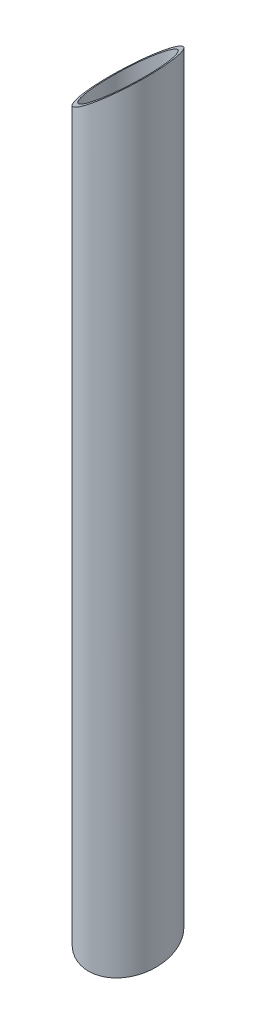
ISO-10303-21;
HEADER;
FILE_DESCRIPTION(('STEP AP214'),'2;1');
FILE_NAME('part.step','',(''),(''),'','','');
FILE_SCHEMA(('AUTOMOTIVE_DESIGN { 1 0 10303 214 1 1 1 1 }'));
ENDSEC;
DATA;
#1=APPLICATION_CONTEXT('core data for automotive mechanical design processes');
#2=APPLICATION_PROTOCOL_DEFINITION('international standard','automotive_design',2000,#1);
#3=PRODUCT_CONTEXT('',#1,'mechanical');
#4=PRODUCT('Part','Part','',(#3));
#5=PRODUCT_RELATED_PRODUCT_CATEGORY('part','',(#4));
#6=PRODUCT_DEFINITION_FORMATION('','',#4);
#7=PRODUCT_DEFINITION_CONTEXT('part definition',#1,'design');
#8=PRODUCT_DEFINITION('design','',#6,#7);
#9=PRODUCT_DEFINITION_SHAPE('','',#8);
#10=(LENGTH_UNIT() NAMED_UNIT(*) SI_UNIT(.MILLI.,.METRE.));
#11=(NAMED_UNIT(*) PLANE_ANGLE_UNIT() SI_UNIT($,.RADIAN.));
#12=(NAMED_UNIT(*) SI_UNIT($,.STERADIAN.) SOLID_ANGLE_UNIT());
#13=UNCERTAINTY_MEASURE_WITH_UNIT(LENGTH_MEASURE(1.E-05),#10,'distance_accuracy_value','');
#14=(GEOMETRIC_REPRESENTATION_CONTEXT(3) GLOBAL_UNCERTAINTY_ASSIGNED_CONTEXT((#13)) GLOBAL_UNIT_ASSIGNED_CONTEXT((#10,
#11,#12)) REPRESENTATION_CONTEXT('',''));
#15=CARTESIAN_POINT('',(0.,0.,0.));
#16=DIRECTION('',(0.,0.,1.));
#17=DIRECTION('',(1.,0.,0.));
#18=AXIS2_PLACEMENT_3D('',#15,#16,#17);
#19=CARTESIAN_POINT('',(0.,400.,0.));
#20=DIRECTION('',(0.,-1.,0.));
#21=DIRECTION('',(0.,0.,-1.));
#22=AXIS2_PLACEMENT_3D('',#19,#20,#21);
#23=CYLINDRICAL_SURFACE('',#22,15.);
#24=CARTESIAN_POINT('',(0.,286.564596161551,0.));
#25=DIRECTION('',(0.615557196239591,-0.783601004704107,-0.0840166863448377));
#26=DIRECTION('',(-0.776402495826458,-0.621264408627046,0.105970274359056));
#27=AXIS2_PLACEMENT_3D('',#24,#25,#26);
#28=ELLIPSE('',#27,19.1423950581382,15.);
#29=CARTESIAN_POINT('',(-14.8622032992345,274.672107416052,2.02852485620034));
#30=VERTEX_POINT('',#29);
#31=EDGE_CURVE('E53',#30,#30,#28,.T.);
#32=ORIENTED_EDGE('',*,*,#31,.T.);
#33=EDGE_LOOP('',(#32));
#34=FACE_BOUND('',#33,.T.);
#35=CARTESIAN_POINT('',(0.,4.01923788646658,0.));
#36=DIRECTION('',(0.,-0.965925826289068,-0.258819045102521));
#37=DIRECTION('',(0.,-0.258819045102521,0.965925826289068));
#38=AXIS2_PLACEMENT_3D('',#35,#36,#37);
#39=ELLIPSE('',#38,15.5291427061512,15.);
#40=CARTESIAN_POINT('',(0.,-2.74086309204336E-13,15.));
#41=VERTEX_POINT('',#40);
#42=EDGE_CURVE('E11',#41,#41,#39,.T.);
#43=ORIENTED_EDGE('',*,*,#42,.F.);
#44=EDGE_LOOP('',(#43));
#45=FACE_BOUND('',#44,.T.);
#46=ADVANCED_FACE('F41',(#34,#45),#23,.T.);
#47=CARTESIAN_POINT('',(0.,400.,0.));
#48=DIRECTION('',(0.,-1.,0.));
#49=DIRECTION('',(0.,0.,-1.));
#50=AXIS2_PLACEMENT_3D('',#47,#48,#49);
#51=CYLINDRICAL_SURFACE('',#50,13.5);
#52=CARTESIAN_POINT('',(0.,286.564596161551,0.));
#53=DIRECTION('',(0.615557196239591,-0.783601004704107,-0.0840166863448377));
#54=DIRECTION('',(-0.776402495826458,-0.621264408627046,0.105970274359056));
#55=AXIS2_PLACEMENT_3D('',#52,#53,#54);
#56=ELLIPSE('',#55,17.2281555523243,13.5);
#57=CARTESIAN_POINT('',(-13.3759829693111,275.861356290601,1.8256723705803));
#58=VERTEX_POINT('',#57);
#59=EDGE_CURVE('E44',#58,#58,#56,.T.);
#60=ORIENTED_EDGE('',*,*,#59,.F.);
#61=EDGE_LOOP('',(#60));
#62=FACE_BOUND('',#61,.T.);
#63=CARTESIAN_POINT('',(0.,4.01923788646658,0.));
#64=DIRECTION('',(0.,-0.965925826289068,-0.258819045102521));
#65=DIRECTION('',(0.,-0.258819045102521,0.965925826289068));
#66=AXIS2_PLACEMENT_3D('',#63,#64,#65);
#67=ELLIPSE('',#66,13.9762284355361,13.5);
#68=CARTESIAN_POINT('',(0.,0.401923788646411,13.5));
#69=VERTEX_POINT('',#68);
#70=EDGE_CURVE('E48',#69,#69,#67,.T.);
#71=ORIENTED_EDGE('',*,*,#70,.T.);
#72=EDGE_LOOP('',(#71));
#73=FACE_BOUND('',#72,.T.);
#74=ADVANCED_FACE('F64',(#62,#73),#51,.F.);
#75=CARTESIAN_POINT('',(502.804634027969,8.03847577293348,-15.0000000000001));
#76=DIRECTION('',(0.,-0.965925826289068,-0.258819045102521));
#77=DIRECTION('',(0.,0.258819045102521,-0.965925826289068));
#78=AXIS2_PLACEMENT_3D('',#75,#76,#77);
#79=PLANE('',#78);
#80=ORIENTED_EDGE('',*,*,#70,.F.);
#81=EDGE_LOOP('',(#80));
#82=FACE_BOUND('',#81,.T.);
#83=ORIENTED_EDGE('',*,*,#42,.T.);
#84=EDGE_LOOP('',(#83));
#85=FACE_BOUND('',#84,.T.);
#86=ADVANCED_FACE('F67',(#82,#85),#79,.T.);
#87=CARTESIAN_POINT('',(40.9857879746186,321.188537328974,-22.6414351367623));
#88=DIRECTION('',(0.615557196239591,-0.783601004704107,-0.0840166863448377));
#89=DIRECTION('',(0.786381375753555,0.617741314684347,0.));
#90=AXIS2_PLACEMENT_3D('',#87,#88,#89);
#91=PLANE('',#90);
#92=ORIENTED_EDGE('',*,*,#59,.T.);
#93=EDGE_LOOP('',(#92));
#94=FACE_BOUND('',#93,.T.);
#95=ORIENTED_EDGE('',*,*,#31,.F.);
#96=EDGE_LOOP('',(#95));
#97=FACE_BOUND('',#96,.T.);
#98=ADVANCED_FACE('F61',(#94,#97),#91,.F.);
#99=CLOSED_SHELL('',(#46,#74,#86,#98));
#100=MANIFOLD_SOLID_BREP('B2',#99);
#101=ADVANCED_BREP_SHAPE_REPRESENTATION('',(#18,#100),#14);
#102=SHAPE_DEFINITION_REPRESENTATION(#9,#101);
ENDSEC;
END-ISO-10303-21;
